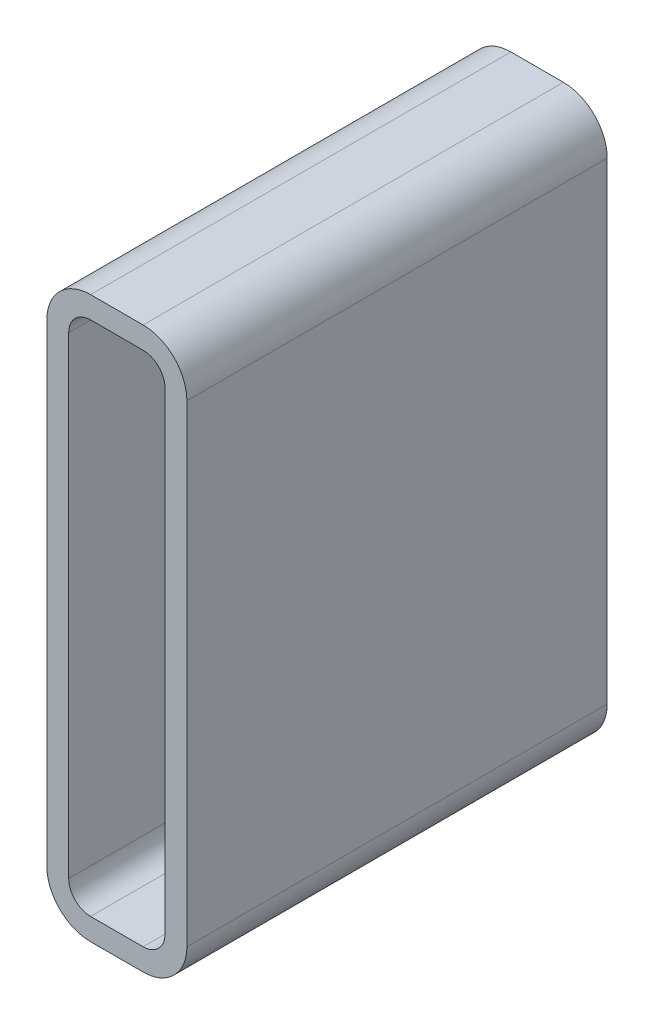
ISO-10303-21;
HEADER;
FILE_DESCRIPTION(('STEP AP214'),'2;1');
FILE_NAME('part.step','',(''),(''),'','','');
FILE_SCHEMA(('AUTOMOTIVE_DESIGN { 1 0 10303 214 1 1 1 1 }'));
ENDSEC;
DATA;
#1=APPLICATION_CONTEXT('core data for automotive mechanical design processes');
#2=APPLICATION_PROTOCOL_DEFINITION('international standard','automotive_design',2000,#1);
#3=PRODUCT_CONTEXT('',#1,'mechanical');
#4=PRODUCT('Part','Part','',(#3));
#5=PRODUCT_RELATED_PRODUCT_CATEGORY('part','',(#4));
#6=PRODUCT_DEFINITION_FORMATION('','',#4);
#7=PRODUCT_DEFINITION_CONTEXT('part definition',#1,'design');
#8=PRODUCT_DEFINITION('design','',#6,#7);
#9=PRODUCT_DEFINITION_SHAPE('','',#8);
#10=(LENGTH_UNIT() NAMED_UNIT(*) SI_UNIT(.MILLI.,.METRE.));
#11=(NAMED_UNIT(*) PLANE_ANGLE_UNIT() SI_UNIT($,.RADIAN.));
#12=(NAMED_UNIT(*) SI_UNIT($,.STERADIAN.) SOLID_ANGLE_UNIT());
#13=UNCERTAINTY_MEASURE_WITH_UNIT(LENGTH_MEASURE(1.E-05),#10,'distance_accuracy_value','');
#14=(GEOMETRIC_REPRESENTATION_CONTEXT(3) GLOBAL_UNCERTAINTY_ASSIGNED_CONTEXT((#13)) GLOBAL_UNIT_ASSIGNED_CONTEXT((#10,
#11,#12)) REPRESENTATION_CONTEXT('',''));
#15=CARTESIAN_POINT('',(0.,0.,0.));
#16=DIRECTION('',(0.,0.,1.));
#17=DIRECTION('',(1.,0.,0.));
#18=AXIS2_PLACEMENT_3D('',#15,#16,#17);
#19=CARTESIAN_POINT('',(33.4251778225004,376.432862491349,304.8));
#20=DIRECTION('',(0.,0.,1.));
#21=DIRECTION('',(1.,0.,0.));
#22=AXIS2_PLACEMENT_3D('',#19,#20,#21);
#23=PLANE('',#22);
#24=CARTESIAN_POINT('',(33.4251778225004,376.432862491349,304.8));
#25=DIRECTION('',(0.,0.,1.));
#26=DIRECTION('',(1.,0.,0.));
#27=AXIS2_PLACEMENT_3D('',#24,#25,#26);
#28=CIRCLE('',#27,31.75);
#29=CARTESIAN_POINT('',(33.4251778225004,408.182862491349,304.8));
#30=VERTEX_POINT('',#29);
#31=CARTESIAN_POINT('',(1.67517782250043,376.432862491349,304.8));
#32=VERTEX_POINT('',#31);
#33=EDGE_CURVE('E211',#30,#32,#28,.T.);
#34=ORIENTED_EDGE('',*,*,#33,.T.);
#35=DIRECTION('',(0.,-1.,0.));
#36=VECTOR('',#35,1.);
#37=CARTESIAN_POINT('',(1.67517782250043,33.5328624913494,304.8));
#38=LINE('',#37,#36);
#39=CARTESIAN_POINT('',(1.67517782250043,33.5328624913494,304.8));
#40=VERTEX_POINT('',#39);
#41=EDGE_CURVE('E214',#32,#40,#38,.T.);
#42=ORIENTED_EDGE('',*,*,#41,.T.);
#43=CARTESIAN_POINT('',(33.4251778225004,33.5328624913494,304.8));
#44=DIRECTION('',(0.,0.,1.));
#45=DIRECTION('',(1.,0.,0.));
#46=AXIS2_PLACEMENT_3D('',#43,#44,#45);
#47=CIRCLE('',#46,31.75);
#48=CARTESIAN_POINT('',(33.4251778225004,1.78286249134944,304.8));
#49=VERTEX_POINT('',#48);
#50=EDGE_CURVE('E217',#40,#49,#47,.T.);
#51=ORIENTED_EDGE('',*,*,#50,.T.);
#52=DIRECTION('',(1.,0.,0.));
#53=VECTOR('',#52,1.);
#54=CARTESIAN_POINT('',(71.5251778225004,1.78286249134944,304.8));
#55=LINE('',#54,#53);
#56=CARTESIAN_POINT('',(71.5251778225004,1.78286249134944,304.8));
#57=VERTEX_POINT('',#56);
#58=EDGE_CURVE('E219',#49,#57,#55,.T.);
#59=ORIENTED_EDGE('',*,*,#58,.T.);
#60=CARTESIAN_POINT('',(71.5251778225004,33.5328624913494,304.8));
#61=DIRECTION('',(0.,0.,1.));
#62=DIRECTION('',(1.,0.,0.));
#63=AXIS2_PLACEMENT_3D('',#60,#61,#62);
#64=CIRCLE('',#63,31.75);
#65=CARTESIAN_POINT('',(103.2751778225,33.5328624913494,304.8));
#66=VERTEX_POINT('',#65);
#67=EDGE_CURVE('E221',#57,#66,#64,.T.);
#68=ORIENTED_EDGE('',*,*,#67,.T.);
#69=DIRECTION('',(0.,1.,0.));
#70=VECTOR('',#69,1.);
#71=CARTESIAN_POINT('',(103.2751778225,376.432862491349,304.8));
#72=LINE('',#71,#70);
#73=CARTESIAN_POINT('',(103.2751778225,376.432862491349,304.8));
#74=VERTEX_POINT('',#73);
#75=EDGE_CURVE('E223',#66,#74,#72,.T.);
#76=ORIENTED_EDGE('',*,*,#75,.T.);
#77=CARTESIAN_POINT('',(71.5251778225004,376.432862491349,304.8));
#78=DIRECTION('',(0.,0.,1.));
#79=DIRECTION('',(1.,0.,0.));
#80=AXIS2_PLACEMENT_3D('',#77,#78,#79);
#81=CIRCLE('',#80,31.75);
#82=CARTESIAN_POINT('',(71.5251778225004,408.182862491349,304.8));
#83=VERTEX_POINT('',#82);
#84=EDGE_CURVE('E225',#74,#83,#81,.T.);
#85=ORIENTED_EDGE('',*,*,#84,.T.);
#86=DIRECTION('',(-1.,0.,0.));
#87=VECTOR('',#86,1.);
#88=CARTESIAN_POINT('',(33.4251778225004,408.182862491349,304.8));
#89=LINE('',#88,#87);
#90=EDGE_CURVE('E227',#83,#30,#89,.T.);
#91=ORIENTED_EDGE('',*,*,#90,.T.);
#92=EDGE_LOOP('',(#34,#42,#51,#59,#68,#76,#85,#91));
#93=FACE_BOUND('',#92,.T.);
#94=DIRECTION('',(0.,-1.,0.));
#95=VECTOR('',#94,1.);
#96=CARTESIAN_POINT('',(17.5501778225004,33.5328624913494,304.8));
#97=LINE('',#96,#95);
#98=CARTESIAN_POINT('',(17.5501778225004,376.432862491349,304.8));
#99=VERTEX_POINT('',#98);
#100=CARTESIAN_POINT('',(17.5501778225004,33.5328624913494,304.8));
#101=VERTEX_POINT('',#100);
#102=EDGE_CURVE('E154',#99,#101,#97,.T.);
#103=ORIENTED_EDGE('',*,*,#102,.F.);
#104=CARTESIAN_POINT('',(33.4251778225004,376.432862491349,304.8));
#105=DIRECTION('',(0.,0.,1.));
#106=DIRECTION('',(1.,0.,0.));
#107=AXIS2_PLACEMENT_3D('',#104,#105,#106);
#108=CIRCLE('',#107,15.875);
#109=CARTESIAN_POINT('',(33.4251778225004,392.307862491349,304.8));
#110=VERTEX_POINT('',#109);
#111=EDGE_CURVE('E146',#110,#99,#108,.T.);
#112=ORIENTED_EDGE('',*,*,#111,.F.);
#113=DIRECTION('',(-1.,0.,0.));
#114=VECTOR('',#113,1.);
#115=CARTESIAN_POINT('',(33.4251778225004,392.307862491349,304.8));
#116=LINE('',#115,#114);
#117=CARTESIAN_POINT('',(71.5251778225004,392.307862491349,304.8));
#118=VERTEX_POINT('',#117);
#119=EDGE_CURVE('E179',#118,#110,#116,.T.);
#120=ORIENTED_EDGE('',*,*,#119,.F.);
#121=CARTESIAN_POINT('',(71.5251778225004,376.432862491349,304.8));
#122=DIRECTION('',(0.,0.,1.));
#123=DIRECTION('',(1.,0.,0.));
#124=AXIS2_PLACEMENT_3D('',#121,#122,#123);
#125=CIRCLE('',#124,15.875);
#126=CARTESIAN_POINT('',(87.4001778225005,376.432862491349,304.8));
#127=VERTEX_POINT('',#126);
#128=EDGE_CURVE('E177',#127,#118,#125,.T.);
#129=ORIENTED_EDGE('',*,*,#128,.F.);
#130=DIRECTION('',(0.,1.,0.));
#131=VECTOR('',#130,1.);
#132=CARTESIAN_POINT('',(87.4001778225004,376.432862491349,304.8));
#133=LINE('',#132,#131);
#134=CARTESIAN_POINT('',(87.4001778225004,33.5328624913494,304.8));
#135=VERTEX_POINT('',#134);
#136=EDGE_CURVE('E175',#135,#127,#133,.T.);
#137=ORIENTED_EDGE('',*,*,#136,.F.);
#138=CARTESIAN_POINT('',(71.5251778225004,33.5328624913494,304.8));
#139=DIRECTION('',(0.,0.,1.));
#140=DIRECTION('',(1.,0.,0.));
#141=AXIS2_PLACEMENT_3D('',#138,#139,#140);
#142=CIRCLE('',#141,15.875);
#143=CARTESIAN_POINT('',(71.5251778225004,17.6578624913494,304.8));
#144=VERTEX_POINT('',#143);
#145=EDGE_CURVE('E173',#144,#135,#142,.T.);
#146=ORIENTED_EDGE('',*,*,#145,.F.);
#147=DIRECTION('',(1.,0.,0.));
#148=VECTOR('',#147,1.);
#149=CARTESIAN_POINT('',(71.5251778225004,17.6578624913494,304.8));
#150=LINE('',#149,#148);
#151=CARTESIAN_POINT('',(33.4251778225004,17.6578624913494,304.8));
#152=VERTEX_POINT('',#151);
#153=EDGE_CURVE('E169',#152,#144,#150,.T.);
#154=ORIENTED_EDGE('',*,*,#153,.F.);
#155=CARTESIAN_POINT('',(33.4251778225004,33.5328624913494,304.8));
#156=DIRECTION('',(0.,0.,1.));
#157=DIRECTION('',(1.,0.,0.));
#158=AXIS2_PLACEMENT_3D('',#155,#156,#157);
#159=CIRCLE('',#158,15.875);
#160=EDGE_CURVE('E167',#101,#152,#159,.T.);
#161=ORIENTED_EDGE('',*,*,#160,.F.);
#162=EDGE_LOOP('',(#103,#112,#120,#129,#137,#146,#154,#161));
#163=FACE_BOUND('',#162,.T.);
#164=ADVANCED_FACE('F33',(#93,#163),#23,.T.);
#165=CARTESIAN_POINT('',(33.4251778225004,376.432862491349,0.));
#166=DIRECTION('',(0.,0.,1.));
#167=DIRECTION('',(1.,0.,0.));
#168=AXIS2_PLACEMENT_3D('',#165,#166,#167);
#169=PLANE('',#168);
#170=CARTESIAN_POINT('',(33.4251778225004,376.432862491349,0.));
#171=DIRECTION('',(0.,0.,1.));
#172=DIRECTION('',(1.,0.,0.));
#173=AXIS2_PLACEMENT_3D('',#170,#171,#172);
#174=CIRCLE('',#173,31.75);
#175=CARTESIAN_POINT('',(33.4251778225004,408.182862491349,0.));
#176=VERTEX_POINT('',#175);
#177=CARTESIAN_POINT('',(1.67517782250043,376.432862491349,0.));
#178=VERTEX_POINT('',#177);
#179=EDGE_CURVE('E162',#176,#178,#174,.T.);
#180=ORIENTED_EDGE('',*,*,#179,.F.);
#181=DIRECTION('',(-1.,0.,0.));
#182=VECTOR('',#181,1.);
#183=CARTESIAN_POINT('',(33.4251778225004,408.182862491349,0.));
#184=LINE('',#183,#182);
#185=CARTESIAN_POINT('',(71.5251778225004,408.182862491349,0.));
#186=VERTEX_POINT('',#185);
#187=EDGE_CURVE('E215',#186,#176,#184,.T.);
#188=ORIENTED_EDGE('',*,*,#187,.F.);
#189=CARTESIAN_POINT('',(71.5251778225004,376.432862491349,0.));
#190=DIRECTION('',(0.,0.,1.));
#191=DIRECTION('',(1.,0.,0.));
#192=AXIS2_PLACEMENT_3D('',#189,#190,#191);
#193=CIRCLE('',#192,31.75);
#194=CARTESIAN_POINT('',(103.2751778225,376.432862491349,0.));
#195=VERTEX_POINT('',#194);
#196=EDGE_CURVE('E242',#195,#186,#193,.T.);
#197=ORIENTED_EDGE('',*,*,#196,.F.);
#198=DIRECTION('',(0.,1.,0.));
#199=VECTOR('',#198,1.);
#200=CARTESIAN_POINT('',(103.2751778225,376.432862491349,0.));
#201=LINE('',#200,#199);
#202=CARTESIAN_POINT('',(103.2751778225,33.5328624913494,0.));
#203=VERTEX_POINT('',#202);
#204=EDGE_CURVE('E240',#203,#195,#201,.T.);
#205=ORIENTED_EDGE('',*,*,#204,.F.);
#206=CARTESIAN_POINT('',(71.5251778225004,33.5328624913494,0.));
#207=DIRECTION('',(0.,0.,1.));
#208=DIRECTION('',(1.,0.,0.));
#209=AXIS2_PLACEMENT_3D('',#206,#207,#208);
#210=CIRCLE('',#209,31.75);
#211=CARTESIAN_POINT('',(71.5251778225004,1.78286249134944,0.));
#212=VERTEX_POINT('',#211);
#213=EDGE_CURVE('E238',#212,#203,#210,.T.);
#214=ORIENTED_EDGE('',*,*,#213,.F.);
#215=DIRECTION('',(1.,0.,0.));
#216=VECTOR('',#215,1.);
#217=CARTESIAN_POINT('',(71.5251778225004,1.78286249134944,0.));
#218=LINE('',#217,#216);
#219=CARTESIAN_POINT('',(33.4251778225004,1.78286249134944,0.));
#220=VERTEX_POINT('',#219);
#221=EDGE_CURVE('E236',#220,#212,#218,.T.);
#222=ORIENTED_EDGE('',*,*,#221,.F.);
#223=CARTESIAN_POINT('',(33.4251778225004,33.5328624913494,0.));
#224=DIRECTION('',(0.,0.,1.));
#225=DIRECTION('',(1.,0.,0.));
#226=AXIS2_PLACEMENT_3D('',#223,#224,#225);
#227=CIRCLE('',#226,31.75);
#228=CARTESIAN_POINT('',(1.67517782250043,33.5328624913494,0.));
#229=VERTEX_POINT('',#228);
#230=EDGE_CURVE('E234',#229,#220,#227,.T.);
#231=ORIENTED_EDGE('',*,*,#230,.F.);
#232=DIRECTION('',(0.,-1.,0.));
#233=VECTOR('',#232,1.);
#234=CARTESIAN_POINT('',(1.67517782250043,33.5328624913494,0.));
#235=LINE('',#234,#233);
#236=EDGE_CURVE('E232',#178,#229,#235,.T.);
#237=ORIENTED_EDGE('',*,*,#236,.F.);
#238=EDGE_LOOP('',(#180,#188,#197,#205,#214,#222,#231,#237));
#239=FACE_BOUND('',#238,.T.);
#240=CARTESIAN_POINT('',(33.4251778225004,376.432862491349,0.));
#241=DIRECTION('',(0.,0.,1.));
#242=DIRECTION('',(1.,0.,0.));
#243=AXIS2_PLACEMENT_3D('',#240,#241,#242);
#244=CIRCLE('',#243,15.875);
#245=CARTESIAN_POINT('',(33.4251778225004,392.307862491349,0.));
#246=VERTEX_POINT('',#245);
#247=CARTESIAN_POINT('',(17.5501778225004,376.432862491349,0.));
#248=VERTEX_POINT('',#247);
#249=EDGE_CURVE('E56',#246,#248,#244,.T.);
#250=ORIENTED_EDGE('',*,*,#249,.T.);
#251=DIRECTION('',(0.,-1.,0.));
#252=VECTOR('',#251,1.);
#253=CARTESIAN_POINT('',(17.5501778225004,33.5328624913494,0.));
#254=LINE('',#253,#252);
#255=CARTESIAN_POINT('',(17.5501778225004,33.5328624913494,0.));
#256=VERTEX_POINT('',#255);
#257=EDGE_CURVE('E161',#248,#256,#254,.T.);
#258=ORIENTED_EDGE('',*,*,#257,.T.);
#259=CARTESIAN_POINT('',(33.4251778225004,33.5328624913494,0.));
#260=DIRECTION('',(0.,0.,1.));
#261=DIRECTION('',(1.,0.,0.));
#262=AXIS2_PLACEMENT_3D('',#259,#260,#261);
#263=CIRCLE('',#262,15.875);
#264=CARTESIAN_POINT('',(33.4251778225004,17.6578624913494,0.));
#265=VERTEX_POINT('',#264);
#266=EDGE_CURVE('E183',#256,#265,#263,.T.);
#267=ORIENTED_EDGE('',*,*,#266,.T.);
#268=DIRECTION('',(1.,0.,0.));
#269=VECTOR('',#268,1.);
#270=CARTESIAN_POINT('',(71.5251778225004,17.6578624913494,0.));
#271=LINE('',#270,#269);
#272=CARTESIAN_POINT('',(71.5251778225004,17.6578624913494,0.));
#273=VERTEX_POINT('',#272);
#274=EDGE_CURVE('E186',#265,#273,#271,.T.);
#275=ORIENTED_EDGE('',*,*,#274,.T.);
#276=CARTESIAN_POINT('',(71.5251778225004,33.5328624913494,0.));
#277=DIRECTION('',(0.,0.,1.));
#278=DIRECTION('',(1.,0.,0.));
#279=AXIS2_PLACEMENT_3D('',#276,#277,#278);
#280=CIRCLE('',#279,15.875);
#281=CARTESIAN_POINT('',(87.4001778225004,33.5328624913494,0.));
#282=VERTEX_POINT('',#281);
#283=EDGE_CURVE('E189',#273,#282,#280,.T.);
#284=ORIENTED_EDGE('',*,*,#283,.T.);
#285=DIRECTION('',(0.,1.,0.));
#286=VECTOR('',#285,1.);
#287=CARTESIAN_POINT('',(87.4001778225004,376.432862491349,0.));
#288=LINE('',#287,#286);
#289=CARTESIAN_POINT('',(87.4001778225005,376.432862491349,0.));
#290=VERTEX_POINT('',#289);
#291=EDGE_CURVE('E192',#282,#290,#288,.T.);
#292=ORIENTED_EDGE('',*,*,#291,.T.);
#293=CARTESIAN_POINT('',(71.5251778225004,376.432862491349,0.));
#294=DIRECTION('',(0.,0.,1.));
#295=DIRECTION('',(1.,0.,0.));
#296=AXIS2_PLACEMENT_3D('',#293,#294,#295);
#297=CIRCLE('',#296,15.875);
#298=CARTESIAN_POINT('',(71.5251778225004,392.307862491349,0.));
#299=VERTEX_POINT('',#298);
#300=EDGE_CURVE('E195',#290,#299,#297,.T.);
#301=ORIENTED_EDGE('',*,*,#300,.T.);
#302=DIRECTION('',(-1.,0.,0.));
#303=VECTOR('',#302,1.);
#304=CARTESIAN_POINT('',(33.4251778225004,392.307862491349,0.));
#305=LINE('',#304,#303);
#306=EDGE_CURVE('E155',#299,#246,#305,.T.);
#307=ORIENTED_EDGE('',*,*,#306,.T.);
#308=EDGE_LOOP('',(#250,#258,#267,#275,#284,#292,#301,#307));
#309=FACE_BOUND('',#308,.T.);
#310=ADVANCED_FACE('F272',(#239,#309),#169,.F.);
#311=CARTESIAN_POINT('',(33.4251778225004,376.432862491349,304.8));
#312=DIRECTION('',(0.,0.,-1.));
#313=DIRECTION('',(-1.,0.,0.));
#314=AXIS2_PLACEMENT_3D('',#311,#312,#313);
#315=CYLINDRICAL_SURFACE('',#314,31.75);
#316=ORIENTED_EDGE('',*,*,#179,.T.);
#317=DIRECTION('',(0.,0.,-1.));
#318=VECTOR('',#317,1.);
#319=CARTESIAN_POINT('',(1.67517782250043,376.432862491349,304.8));
#320=LINE('',#319,#318);
#321=EDGE_CURVE('E11',#32,#178,#320,.T.);
#322=ORIENTED_EDGE('',*,*,#321,.F.);
#323=ORIENTED_EDGE('',*,*,#33,.F.);
#324=DIRECTION('',(0.,0.,-1.));
#325=VECTOR('',#324,1.);
#326=CARTESIAN_POINT('',(33.4251778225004,408.182862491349,304.8));
#327=LINE('',#326,#325);
#328=EDGE_CURVE('E229',#30,#176,#327,.T.);
#329=ORIENTED_EDGE('',*,*,#328,.T.);
#330=EDGE_LOOP('',(#316,#322,#323,#329));
#331=FACE_BOUND('',#330,.T.);
#332=ADVANCED_FACE('F35',(#331),#315,.T.);
#333=CARTESIAN_POINT('',(1.67517782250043,33.5328624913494,304.8));
#334=DIRECTION('',(1.,0.,0.));
#335=DIRECTION('',(0.,0.,-1.));
#336=AXIS2_PLACEMENT_3D('',#333,#334,#335);
#337=PLANE('',#336);
#338=ORIENTED_EDGE('',*,*,#236,.T.);
#339=DIRECTION('',(0.,0.,-1.));
#340=VECTOR('',#339,1.);
#341=CARTESIAN_POINT('',(1.67517782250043,33.5328624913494,304.8));
#342=LINE('',#341,#340);
#343=EDGE_CURVE('E41',#40,#229,#342,.T.);
#344=ORIENTED_EDGE('',*,*,#343,.F.);
#345=ORIENTED_EDGE('',*,*,#41,.F.);
#346=ORIENTED_EDGE('',*,*,#321,.T.);
#347=EDGE_LOOP('',(#338,#344,#345,#346));
#348=FACE_BOUND('',#347,.T.);
#349=ADVANCED_FACE('F289',(#348),#337,.F.);
#350=CARTESIAN_POINT('',(33.4251778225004,33.5328624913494,304.8));
#351=DIRECTION('',(0.,0.,-1.));
#352=DIRECTION('',(-1.,0.,0.));
#353=AXIS2_PLACEMENT_3D('',#350,#351,#352);
#354=CYLINDRICAL_SURFACE('',#353,31.75);
#355=ORIENTED_EDGE('',*,*,#230,.T.);
#356=DIRECTION('',(0.,0.,-1.));
#357=VECTOR('',#356,1.);
#358=CARTESIAN_POINT('',(33.4251778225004,1.78286249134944,304.8));
#359=LINE('',#358,#357);
#360=EDGE_CURVE('E259',#49,#220,#359,.T.);
#361=ORIENTED_EDGE('',*,*,#360,.F.);
#362=ORIENTED_EDGE('',*,*,#50,.F.);
#363=ORIENTED_EDGE('',*,*,#343,.T.);
#364=EDGE_LOOP('',(#355,#361,#362,#363));
#365=FACE_BOUND('',#364,.T.);
#366=ADVANCED_FACE('F266',(#365),#354,.T.);
#367=CARTESIAN_POINT('',(71.5251778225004,1.78286249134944,304.8));
#368=DIRECTION('',(0.,1.,0.));
#369=DIRECTION('',(0.,0.,1.));
#370=AXIS2_PLACEMENT_3D('',#367,#368,#369);
#371=PLANE('',#370);
#372=ORIENTED_EDGE('',*,*,#221,.T.);
#373=DIRECTION('',(0.,0.,-1.));
#374=VECTOR('',#373,1.);
#375=CARTESIAN_POINT('',(71.5251778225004,1.78286249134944,304.8));
#376=LINE('',#375,#374);
#377=EDGE_CURVE('E256',#57,#212,#376,.T.);
#378=ORIENTED_EDGE('',*,*,#377,.F.);
#379=ORIENTED_EDGE('',*,*,#58,.F.);
#380=ORIENTED_EDGE('',*,*,#360,.T.);
#381=EDGE_LOOP('',(#372,#378,#379,#380));
#382=FACE_BOUND('',#381,.T.);
#383=ADVANCED_FACE('F278',(#382),#371,.F.);
#384=CARTESIAN_POINT('',(71.5251778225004,33.5328624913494,304.8));
#385=DIRECTION('',(0.,0.,-1.));
#386=DIRECTION('',(-1.,0.,0.));
#387=AXIS2_PLACEMENT_3D('',#384,#385,#386);
#388=CYLINDRICAL_SURFACE('',#387,31.75);
#389=ORIENTED_EDGE('',*,*,#213,.T.);
#390=DIRECTION('',(0.,0.,-1.));
#391=VECTOR('',#390,1.);
#392=CARTESIAN_POINT('',(103.2751778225,33.5328624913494,304.8));
#393=LINE('',#392,#391);
#394=EDGE_CURVE('E253',#66,#203,#393,.T.);
#395=ORIENTED_EDGE('',*,*,#394,.F.);
#396=ORIENTED_EDGE('',*,*,#67,.F.);
#397=ORIENTED_EDGE('',*,*,#377,.T.);
#398=EDGE_LOOP('',(#389,#395,#396,#397));
#399=FACE_BOUND('',#398,.T.);
#400=ADVANCED_FACE('F282',(#399),#388,.T.);
#401=CARTESIAN_POINT('',(103.2751778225,376.432862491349,304.8));
#402=DIRECTION('',(-1.,0.,0.));
#403=DIRECTION('',(0.,0.,1.));
#404=AXIS2_PLACEMENT_3D('',#401,#402,#403);
#405=PLANE('',#404);
#406=ORIENTED_EDGE('',*,*,#204,.T.);
#407=DIRECTION('',(0.,0.,-1.));
#408=VECTOR('',#407,1.);
#409=CARTESIAN_POINT('',(103.2751778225,376.432862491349,304.8));
#410=LINE('',#409,#408);
#411=EDGE_CURVE('E250',#74,#195,#410,.T.);
#412=ORIENTED_EDGE('',*,*,#411,.F.);
#413=ORIENTED_EDGE('',*,*,#75,.F.);
#414=ORIENTED_EDGE('',*,*,#394,.T.);
#415=EDGE_LOOP('',(#406,#412,#413,#414));
#416=FACE_BOUND('',#415,.T.);
#417=ADVANCED_FACE('F302',(#416),#405,.F.);
#418=CARTESIAN_POINT('',(71.5251778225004,376.432862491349,304.8));
#419=DIRECTION('',(0.,0.,-1.));
#420=DIRECTION('',(-1.,0.,0.));
#421=AXIS2_PLACEMENT_3D('',#418,#419,#420);
#422=CYLINDRICAL_SURFACE('',#421,31.75);
#423=ORIENTED_EDGE('',*,*,#196,.T.);
#424=DIRECTION('',(0.,0.,-1.));
#425=VECTOR('',#424,1.);
#426=CARTESIAN_POINT('',(71.5251778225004,408.182862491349,304.8));
#427=LINE('',#426,#425);
#428=EDGE_CURVE('E247',#83,#186,#427,.T.);
#429=ORIENTED_EDGE('',*,*,#428,.F.);
#430=ORIENTED_EDGE('',*,*,#84,.F.);
#431=ORIENTED_EDGE('',*,*,#411,.T.);
#432=EDGE_LOOP('',(#423,#429,#430,#431));
#433=FACE_BOUND('',#432,.T.);
#434=ADVANCED_FACE('F300',(#433),#422,.T.);
#435=CARTESIAN_POINT('',(33.4251778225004,408.182862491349,304.8));
#436=DIRECTION('',(0.,-1.,0.));
#437=DIRECTION('',(0.,0.,-1.));
#438=AXIS2_PLACEMENT_3D('',#435,#436,#437);
#439=PLANE('',#438);
#440=ORIENTED_EDGE('',*,*,#187,.T.);
#441=ORIENTED_EDGE('',*,*,#328,.F.);
#442=ORIENTED_EDGE('',*,*,#90,.F.);
#443=ORIENTED_EDGE('',*,*,#428,.T.);
#444=EDGE_LOOP('',(#440,#441,#442,#443));
#445=FACE_BOUND('',#444,.T.);
#446=ADVANCED_FACE('F295',(#445),#439,.F.);
#447=CARTESIAN_POINT('',(33.4251778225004,376.432862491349,304.8));
#448=DIRECTION('',(0.,0.,-1.));
#449=DIRECTION('',(-1.,0.,0.));
#450=AXIS2_PLACEMENT_3D('',#447,#448,#449);
#451=CYLINDRICAL_SURFACE('',#450,15.875);
#452=ORIENTED_EDGE('',*,*,#249,.F.);
#453=DIRECTION('',(0.,0.,-1.));
#454=VECTOR('',#453,1.);
#455=CARTESIAN_POINT('',(33.4251778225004,392.307862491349,304.8));
#456=LINE('',#455,#454);
#457=EDGE_CURVE('E150',#110,#246,#456,.T.);
#458=ORIENTED_EDGE('',*,*,#457,.F.);
#459=ORIENTED_EDGE('',*,*,#111,.T.);
#460=DIRECTION('',(0.,0.,-1.));
#461=VECTOR('',#460,1.);
#462=CARTESIAN_POINT('',(17.5501778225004,376.432862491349,304.8));
#463=LINE('',#462,#461);
#464=EDGE_CURVE('E149',#99,#248,#463,.T.);
#465=ORIENTED_EDGE('',*,*,#464,.T.);
#466=EDGE_LOOP('',(#452,#458,#459,#465));
#467=FACE_BOUND('',#466,.T.);
#468=ADVANCED_FACE('F148',(#467),#451,.F.);
#469=CARTESIAN_POINT('',(17.5501778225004,33.5328624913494,304.8));
#470=DIRECTION('',(1.,0.,0.));
#471=DIRECTION('',(0.,0.,-1.));
#472=AXIS2_PLACEMENT_3D('',#469,#470,#471);
#473=PLANE('',#472);
#474=ORIENTED_EDGE('',*,*,#257,.F.);
#475=ORIENTED_EDGE('',*,*,#464,.F.);
#476=ORIENTED_EDGE('',*,*,#102,.T.);
#477=DIRECTION('',(0.,0.,-1.));
#478=VECTOR('',#477,1.);
#479=CARTESIAN_POINT('',(17.5501778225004,33.5328624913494,304.8));
#480=LINE('',#479,#478);
#481=EDGE_CURVE('E163',#101,#256,#480,.T.);
#482=ORIENTED_EDGE('',*,*,#481,.T.);
#483=EDGE_LOOP('',(#474,#475,#476,#482));
#484=FACE_BOUND('',#483,.T.);
#485=ADVANCED_FACE('F158',(#484),#473,.T.);
#486=CARTESIAN_POINT('',(33.4251778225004,33.5328624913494,304.8));
#487=DIRECTION('',(0.,0.,-1.));
#488=DIRECTION('',(-1.,0.,0.));
#489=AXIS2_PLACEMENT_3D('',#486,#487,#488);
#490=CYLINDRICAL_SURFACE('',#489,15.875);
#491=ORIENTED_EDGE('',*,*,#266,.F.);
#492=ORIENTED_EDGE('',*,*,#481,.F.);
#493=ORIENTED_EDGE('',*,*,#160,.T.);
#494=DIRECTION('',(0.,0.,-1.));
#495=VECTOR('',#494,1.);
#496=CARTESIAN_POINT('',(33.4251778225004,17.6578624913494,304.8));
#497=LINE('',#496,#495);
#498=EDGE_CURVE('E208',#152,#265,#497,.T.);
#499=ORIENTED_EDGE('',*,*,#498,.T.);
#500=EDGE_LOOP('',(#491,#492,#493,#499));
#501=FACE_BOUND('',#500,.T.);
#502=ADVANCED_FACE('F327',(#501),#490,.F.);
#503=CARTESIAN_POINT('',(71.5251778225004,17.6578624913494,304.8));
#504=DIRECTION('',(0.,1.,0.));
#505=DIRECTION('',(0.,0.,1.));
#506=AXIS2_PLACEMENT_3D('',#503,#504,#505);
#507=PLANE('',#506);
#508=ORIENTED_EDGE('',*,*,#274,.F.);
#509=ORIENTED_EDGE('',*,*,#498,.F.);
#510=ORIENTED_EDGE('',*,*,#153,.T.);
#511=DIRECTION('',(0.,0.,-1.));
#512=VECTOR('',#511,1.);
#513=CARTESIAN_POINT('',(71.5251778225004,17.6578624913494,304.8));
#514=LINE('',#513,#512);
#515=EDGE_CURVE('E206',#144,#273,#514,.T.);
#516=ORIENTED_EDGE('',*,*,#515,.T.);
#517=EDGE_LOOP('',(#508,#509,#510,#516));
#518=FACE_BOUND('',#517,.T.);
#519=ADVANCED_FACE('F331',(#518),#507,.T.);
#520=CARTESIAN_POINT('',(71.5251778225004,33.5328624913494,304.8));
#521=DIRECTION('',(0.,0.,-1.));
#522=DIRECTION('',(-1.,0.,0.));
#523=AXIS2_PLACEMENT_3D('',#520,#521,#522);
#524=CYLINDRICAL_SURFACE('',#523,15.875);
#525=ORIENTED_EDGE('',*,*,#283,.F.);
#526=ORIENTED_EDGE('',*,*,#515,.F.);
#527=ORIENTED_EDGE('',*,*,#145,.T.);
#528=DIRECTION('',(0.,0.,-1.));
#529=VECTOR('',#528,1.);
#530=CARTESIAN_POINT('',(87.4001778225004,33.5328624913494,304.8));
#531=LINE('',#530,#529);
#532=EDGE_CURVE('E204',#135,#282,#531,.T.);
#533=ORIENTED_EDGE('',*,*,#532,.T.);
#534=EDGE_LOOP('',(#525,#526,#527,#533));
#535=FACE_BOUND('',#534,.T.);
#536=ADVANCED_FACE('F337',(#535),#524,.F.);
#537=CARTESIAN_POINT('',(87.4001778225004,376.432862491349,304.8));
#538=DIRECTION('',(-1.,0.,0.));
#539=DIRECTION('',(0.,0.,1.));
#540=AXIS2_PLACEMENT_3D('',#537,#538,#539);
#541=PLANE('',#540);
#542=ORIENTED_EDGE('',*,*,#291,.F.);
#543=ORIENTED_EDGE('',*,*,#532,.F.);
#544=ORIENTED_EDGE('',*,*,#136,.T.);
#545=DIRECTION('',(0.,0.,-1.));
#546=VECTOR('',#545,1.);
#547=CARTESIAN_POINT('',(87.4001778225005,376.432862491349,304.8));
#548=LINE('',#547,#546);
#549=EDGE_CURVE('E202',#127,#290,#548,.T.);
#550=ORIENTED_EDGE('',*,*,#549,.T.);
#551=EDGE_LOOP('',(#542,#543,#544,#550));
#552=FACE_BOUND('',#551,.T.);
#553=ADVANCED_FACE('F341',(#552),#541,.T.);
#554=CARTESIAN_POINT('',(71.5251778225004,376.432862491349,304.8));
#555=DIRECTION('',(0.,0.,-1.));
#556=DIRECTION('',(-1.,0.,0.));
#557=AXIS2_PLACEMENT_3D('',#554,#555,#556);
#558=CYLINDRICAL_SURFACE('',#557,15.875);
#559=ORIENTED_EDGE('',*,*,#300,.F.);
#560=ORIENTED_EDGE('',*,*,#549,.F.);
#561=ORIENTED_EDGE('',*,*,#128,.T.);
#562=DIRECTION('',(0.,0.,-1.));
#563=VECTOR('',#562,1.);
#564=CARTESIAN_POINT('',(71.5251778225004,392.307862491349,304.8));
#565=LINE('',#564,#563);
#566=EDGE_CURVE('E48',#118,#299,#565,.T.);
#567=ORIENTED_EDGE('',*,*,#566,.T.);
#568=EDGE_LOOP('',(#559,#560,#561,#567));
#569=FACE_BOUND('',#568,.T.);
#570=ADVANCED_FACE('F345',(#569),#558,.F.);
#571=CARTESIAN_POINT('',(33.4251778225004,392.307862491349,304.8));
#572=DIRECTION('',(0.,-1.,0.));
#573=DIRECTION('',(0.,0.,-1.));
#574=AXIS2_PLACEMENT_3D('',#571,#572,#573);
#575=PLANE('',#574);
#576=ORIENTED_EDGE('',*,*,#306,.F.);
#577=ORIENTED_EDGE('',*,*,#566,.F.);
#578=ORIENTED_EDGE('',*,*,#119,.T.);
#579=ORIENTED_EDGE('',*,*,#457,.T.);
#580=EDGE_LOOP('',(#576,#577,#578,#579));
#581=FACE_BOUND('',#580,.T.);
#582=ADVANCED_FACE('F349',(#581),#575,.T.);
#583=CLOSED_SHELL('',(#164,#310,#332,#349,#366,#383,#400,#417,#434,#446,#468,#485,#502,#519,
#536,#553,#570,#582));
#584=MANIFOLD_SOLID_BREP('B2',#583);
#585=ADVANCED_BREP_SHAPE_REPRESENTATION('',(#18,#584),#14);
#586=SHAPE_DEFINITION_REPRESENTATION(#9,#585);
ENDSEC;
END-ISO-10303-21;
